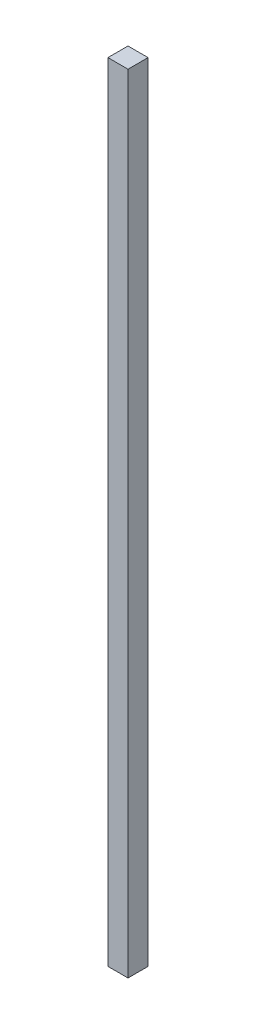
ISO-10303-21;
HEADER;
FILE_DESCRIPTION(('STEP AP214'),'2;1');
FILE_NAME('part.step','',(''),(''),'','','');
FILE_SCHEMA(('AUTOMOTIVE_DESIGN { 1 0 10303 214 1 1 1 1 }'));
ENDSEC;
DATA;
#1=APPLICATION_CONTEXT('core data for automotive mechanical design processes');
#2=APPLICATION_PROTOCOL_DEFINITION('international standard','automotive_design',2000,#1);
#3=PRODUCT_CONTEXT('',#1,'mechanical');
#4=PRODUCT('Part','Part','',(#3));
#5=PRODUCT_RELATED_PRODUCT_CATEGORY('part','',(#4));
#6=PRODUCT_DEFINITION_FORMATION('','',#4);
#7=PRODUCT_DEFINITION_CONTEXT('part definition',#1,'design');
#8=PRODUCT_DEFINITION('design','',#6,#7);
#9=PRODUCT_DEFINITION_SHAPE('','',#8);
#10=(LENGTH_UNIT() NAMED_UNIT(*) SI_UNIT(.MILLI.,.METRE.));
#11=(NAMED_UNIT(*) PLANE_ANGLE_UNIT() SI_UNIT($,.RADIAN.));
#12=(NAMED_UNIT(*) SI_UNIT($,.STERADIAN.) SOLID_ANGLE_UNIT());
#13=UNCERTAINTY_MEASURE_WITH_UNIT(LENGTH_MEASURE(1.E-05),#10,'distance_accuracy_value','');
#14=(GEOMETRIC_REPRESENTATION_CONTEXT(3) GLOBAL_UNCERTAINTY_ASSIGNED_CONTEXT((#13)) GLOBAL_UNIT_ASSIGNED_CONTEXT((#10,
#11,#12)) REPRESENTATION_CONTEXT('',''));
#15=CARTESIAN_POINT('',(0.,0.,0.));
#16=DIRECTION('',(0.,0.,1.));
#17=DIRECTION('',(1.,0.,0.));
#18=AXIS2_PLACEMENT_3D('',#15,#16,#17);
#19=CARTESIAN_POINT('',(0.,1960.,0.));
#20=DIRECTION('',(1.,0.,0.));
#21=DIRECTION('',(0.,0.,-1.));
#22=AXIS2_PLACEMENT_3D('',#19,#20,#21);
#23=PLANE('',#22);
#24=DIRECTION('',(0.,0.,1.));
#25=VECTOR('',#24,1.);
#26=CARTESIAN_POINT('',(0.,0.,0.));
#27=LINE('',#26,#25);
#28=CARTESIAN_POINT('',(0.,0.,-50.));
#29=VERTEX_POINT('',#28);
#30=CARTESIAN_POINT('',(0.,0.,0.));
#31=VERTEX_POINT('',#30);
#32=EDGE_CURVE('E95',#29,#31,#27,.T.);
#33=ORIENTED_EDGE('',*,*,#32,.T.);
#34=DIRECTION('',(0.,-1.,0.));
#35=VECTOR('',#34,1.);
#36=CARTESIAN_POINT('',(0.,1960.,0.));
#37=LINE('',#36,#35);
#38=CARTESIAN_POINT('',(0.,1960.,0.));
#39=VERTEX_POINT('',#38);
#40=EDGE_CURVE('E11',#39,#31,#37,.T.);
#41=ORIENTED_EDGE('',*,*,#40,.F.);
#42=DIRECTION('',(0.,0.,1.));
#43=VECTOR('',#42,1.);
#44=CARTESIAN_POINT('',(0.,1960.,0.));
#45=LINE('',#44,#43);
#46=CARTESIAN_POINT('',(0.,1960.,-50.));
#47=VERTEX_POINT('',#46);
#48=EDGE_CURVE('E83',#47,#39,#45,.T.);
#49=ORIENTED_EDGE('',*,*,#48,.F.);
#50=DIRECTION('',(0.,-1.,0.));
#51=VECTOR('',#50,1.);
#52=CARTESIAN_POINT('',(0.,1960.,-50.));
#53=LINE('',#52,#51);
#54=EDGE_CURVE('E91',#47,#29,#53,.T.);
#55=ORIENTED_EDGE('',*,*,#54,.T.);
#56=EDGE_LOOP('',(#33,#41,#49,#55));
#57=FACE_BOUND('',#56,.T.);
#58=ADVANCED_FACE('F32',(#57),#23,.F.);
#59=CARTESIAN_POINT('',(0.,1960.,0.));
#60=DIRECTION('',(0.,0.,-1.));
#61=DIRECTION('',(-1.,0.,0.));
#62=AXIS2_PLACEMENT_3D('',#59,#60,#61);
#63=PLANE('',#62);
#64=DIRECTION('',(1.,0.,0.));
#65=VECTOR('',#64,1.);
#66=CARTESIAN_POINT('',(0.,0.,0.));
#67=LINE('',#66,#65);
#68=CARTESIAN_POINT('',(50.,0.,0.));
#69=VERTEX_POINT('',#68);
#70=EDGE_CURVE('E87',#31,#69,#67,.T.);
#71=ORIENTED_EDGE('',*,*,#70,.T.);
#72=DIRECTION('',(0.,-1.,0.));
#73=VECTOR('',#72,1.);
#74=CARTESIAN_POINT('',(50.,1960.,0.));
#75=LINE('',#74,#73);
#76=CARTESIAN_POINT('',(50.,1960.,0.));
#77=VERTEX_POINT('',#76);
#78=EDGE_CURVE('E40',#77,#69,#75,.T.);
#79=ORIENTED_EDGE('',*,*,#78,.F.);
#80=DIRECTION('',(1.,0.,0.));
#81=VECTOR('',#80,1.);
#82=CARTESIAN_POINT('',(0.,1960.,0.));
#83=LINE('',#82,#81);
#84=EDGE_CURVE('E78',#39,#77,#83,.T.);
#85=ORIENTED_EDGE('',*,*,#84,.F.);
#86=ORIENTED_EDGE('',*,*,#40,.T.);
#87=EDGE_LOOP('',(#71,#79,#85,#86));
#88=FACE_BOUND('',#87,.T.);
#89=ADVANCED_FACE('F86',(#88),#63,.F.);
#90=CARTESIAN_POINT('',(50.,1960.,0.));
#91=DIRECTION('',(-1.,0.,0.));
#92=DIRECTION('',(0.,0.,1.));
#93=AXIS2_PLACEMENT_3D('',#90,#91,#92);
#94=PLANE('',#93);
#95=DIRECTION('',(0.,0.,-1.));
#96=VECTOR('',#95,1.);
#97=CARTESIAN_POINT('',(50.,0.,0.));
#98=LINE('',#97,#96);
#99=CARTESIAN_POINT('',(50.,0.,-50.));
#100=VERTEX_POINT('',#99);
#101=EDGE_CURVE('E65',#69,#100,#98,.T.);
#102=ORIENTED_EDGE('',*,*,#101,.T.);
#103=DIRECTION('',(0.,-1.,0.));
#104=VECTOR('',#103,1.);
#105=CARTESIAN_POINT('',(50.,1960.,-50.));
#106=LINE('',#105,#104);
#107=CARTESIAN_POINT('',(50.,1960.,-50.));
#108=VERTEX_POINT('',#107);
#109=EDGE_CURVE('E88',#108,#100,#106,.T.);
#110=ORIENTED_EDGE('',*,*,#109,.F.);
#111=DIRECTION('',(0.,0.,-1.));
#112=VECTOR('',#111,1.);
#113=CARTESIAN_POINT('',(50.,1960.,0.));
#114=LINE('',#113,#112);
#115=EDGE_CURVE('E81',#77,#108,#114,.T.);
#116=ORIENTED_EDGE('',*,*,#115,.F.);
#117=ORIENTED_EDGE('',*,*,#78,.T.);
#118=EDGE_LOOP('',(#102,#110,#116,#117));
#119=FACE_BOUND('',#118,.T.);
#120=ADVANCED_FACE('F89',(#119),#94,.F.);
#121=CARTESIAN_POINT('',(0.,1960.,-50.));
#122=DIRECTION('',(0.,0.,1.));
#123=DIRECTION('',(1.,0.,0.));
#124=AXIS2_PLACEMENT_3D('',#121,#122,#123);
#125=PLANE('',#124);
#126=DIRECTION('',(-1.,0.,0.));
#127=VECTOR('',#126,1.);
#128=CARTESIAN_POINT('',(0.,0.,-50.));
#129=LINE('',#128,#127);
#130=EDGE_CURVE('E71',#100,#29,#129,.T.);
#131=ORIENTED_EDGE('',*,*,#130,.T.);
#132=ORIENTED_EDGE('',*,*,#54,.F.);
#133=DIRECTION('',(-1.,0.,0.));
#134=VECTOR('',#133,1.);
#135=CARTESIAN_POINT('',(0.,1960.,-50.));
#136=LINE('',#135,#134);
#137=EDGE_CURVE('E48',#108,#47,#136,.T.);
#138=ORIENTED_EDGE('',*,*,#137,.F.);
#139=ORIENTED_EDGE('',*,*,#109,.T.);
#140=EDGE_LOOP('',(#131,#132,#138,#139));
#141=FACE_BOUND('',#140,.T.);
#142=ADVANCED_FACE('F102',(#141),#125,.F.);
#143=CARTESIAN_POINT('',(0.,1960.,-50.));
#144=DIRECTION('',(0.,-1.,0.));
#145=DIRECTION('',(0.,0.,-1.));
#146=AXIS2_PLACEMENT_3D('',#143,#144,#145);
#147=PLANE('',#146);
#148=ORIENTED_EDGE('',*,*,#48,.T.);
#149=ORIENTED_EDGE('',*,*,#84,.T.);
#150=ORIENTED_EDGE('',*,*,#115,.T.);
#151=ORIENTED_EDGE('',*,*,#137,.T.);
#152=EDGE_LOOP('',(#148,#149,#150,#151));
#153=FACE_BOUND('',#152,.T.);
#154=ADVANCED_FACE('F79',(#153),#147,.F.);
#155=CARTESIAN_POINT('',(0.,0.,-50.));
#156=DIRECTION('',(0.,-1.,0.));
#157=DIRECTION('',(0.,0.,-1.));
#158=AXIS2_PLACEMENT_3D('',#155,#156,#157);
#159=PLANE('',#158);
#160=ORIENTED_EDGE('',*,*,#32,.F.);
#161=ORIENTED_EDGE('',*,*,#130,.F.);
#162=ORIENTED_EDGE('',*,*,#101,.F.);
#163=ORIENTED_EDGE('',*,*,#70,.F.);
#164=EDGE_LOOP('',(#160,#161,#162,#163));
#165=FACE_BOUND('',#164,.T.);
#166=ADVANCED_FACE('F105',(#165),#159,.T.);
#167=CLOSED_SHELL('',(#58,#89,#120,#142,#154,#166));
#168=MANIFOLD_SOLID_BREP('B2',#167);
#169=ADVANCED_BREP_SHAPE_REPRESENTATION('',(#18,#168),#14);
#170=SHAPE_DEFINITION_REPRESENTATION(#9,#169);
ENDSEC;
END-ISO-10303-21;
